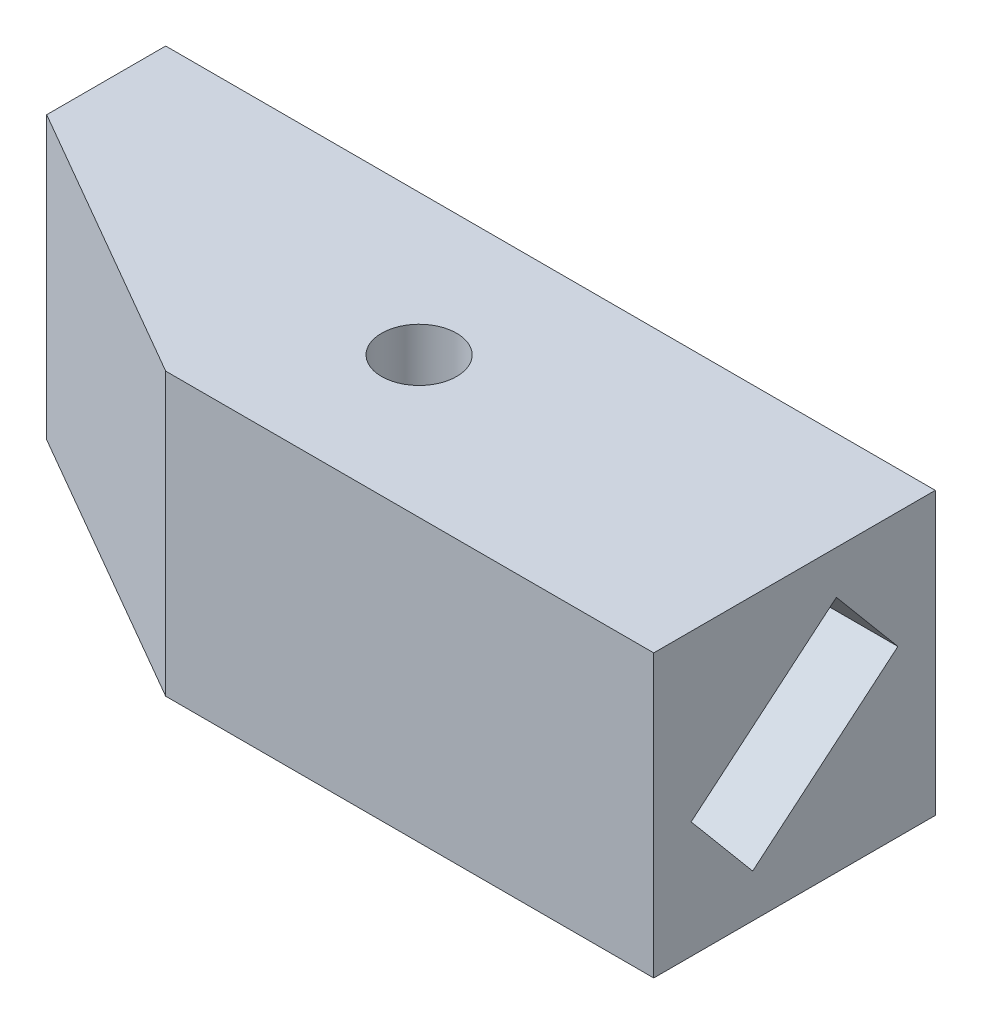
from build123d import *

# Parameters (mm, degrees)
EXTRUDE_1_DEPTH     = 30
SKETCH_2_R          = 4
CUT_EXTRUDE_1_DEPTH = 49.476798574
CUT_EXTRUDE_4_DEPTH = 30
SKETCH1_W           = 30
SKETCH1_H           = 30
BOSS_EXTRUDE1_DEPTH = 27
CHAMFER1_SIZE       = 30
CHAMFER1_SIZE2      = 17.320508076


with BuildPart() as part:
    # Sketch 1 → Extrude 1 (new body)
    with BuildSketch(Plane(origin=(0, 0, 0), x_dir=(1, 0, 0), z_dir=(0, 1, 0))):
        Polygon((-20, 15), (-35, 15), (-35, -15), (-20, -15), (20, -15), (20, 15), align=None)
    extrude(amount=EXTRUDE_1_DEPTH)

    # Sketch 2 → Cut-Extrude 1 (cut, through all)
    with BuildSketch(Plane(origin=(0, 30, 0), x_dir=(1, 0, 0), z_dir=(0, 1, 0))):
        with Locations(Location((-20, 0, 0), (0, 0, 270))):
            Circle(SKETCH_2_R)
    extrude(amount=-CUT_EXTRUDE_1_DEPTH, mode=Mode.SUBTRACT)

    # Sketch 5 → Cut-Extrude 4 (cut)
    with BuildSketch(Plane(origin=(20, 0, 0), x_dir=(0, 0, -1), z_dir=(1, 0, 0))):
        Polygon((11.015265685, 17.585328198), (4.458832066, 25.398981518), (-11.015265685, 12.414671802), (-4.458832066, 4.601018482), align=None)
    extrude(amount=-CUT_EXTRUDE_4_DEPTH, mode=Mode.SUBTRACT)

    # Sketch1 → Boss-Extrude1 (add)
    with BuildSketch(Plane.ZY.offset(35)):
        with Locations((0, 15)):
            Rectangle(SKETCH1_W, SKETCH1_H)
    extrude(amount=BOSS_EXTRUDE1_DEPTH)

    # Chamfer1
    chamfer1_edges = [part.edges().sort_by_distance(p)[0] for p in [
        (-62, 15, 15),
    ]]
    chamfer1_side = [part.faces().sort_by_distance(p)[0] for p in [
        (-21, 15, 15),
    ]]
    chamfer(chamfer1_edges, length=CHAMFER1_SIZE, length2=CHAMFER1_SIZE2, reference=chamfer1_side[0])


solid = part.part
